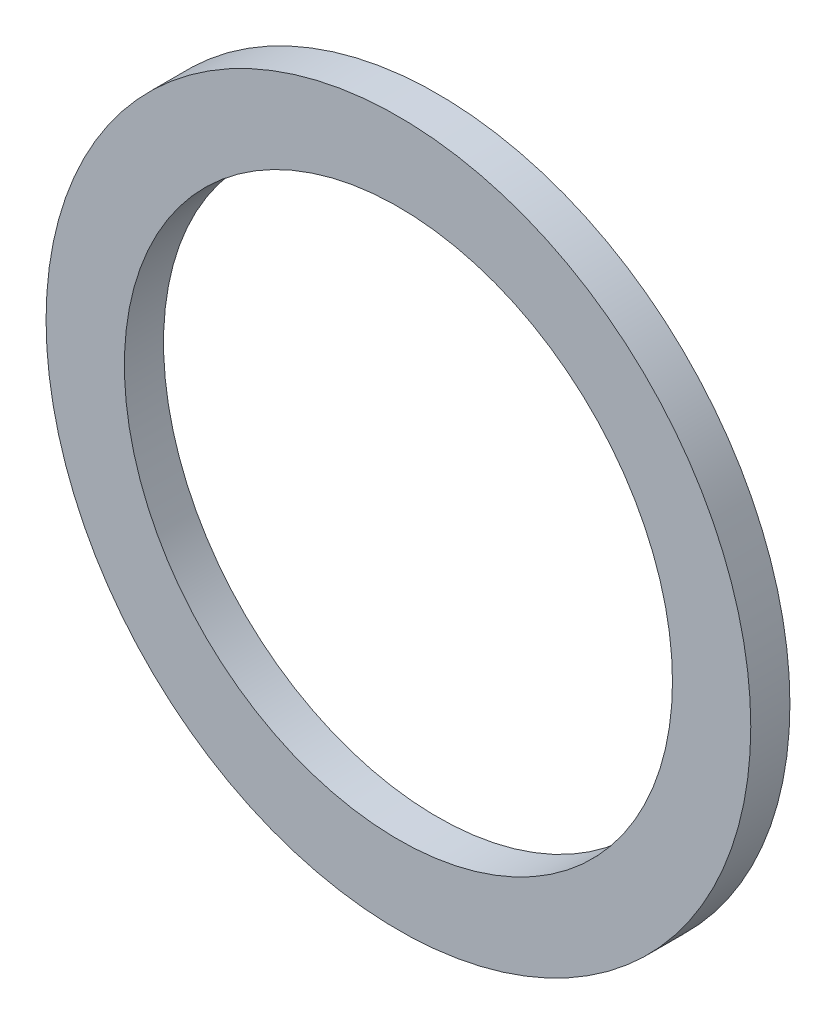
ISO-10303-21;
HEADER;
FILE_DESCRIPTION(('STEP AP214'),'2;1');
FILE_NAME('part.step','',(''),(''),'','','');
FILE_SCHEMA(('AUTOMOTIVE_DESIGN { 1 0 10303 214 1 1 1 1 }'));
ENDSEC;
DATA;
#1=APPLICATION_CONTEXT('core data for automotive mechanical design processes');
#2=APPLICATION_PROTOCOL_DEFINITION('international standard','automotive_design',2000,#1);
#3=PRODUCT_CONTEXT('',#1,'mechanical');
#4=PRODUCT('Part','Part','',(#3));
#5=PRODUCT_RELATED_PRODUCT_CATEGORY('part','',(#4));
#6=PRODUCT_DEFINITION_FORMATION('','',#4);
#7=PRODUCT_DEFINITION_CONTEXT('part definition',#1,'design');
#8=PRODUCT_DEFINITION('design','',#6,#7);
#9=PRODUCT_DEFINITION_SHAPE('','',#8);
#10=(LENGTH_UNIT() NAMED_UNIT(*) SI_UNIT(.MILLI.,.METRE.));
#11=(NAMED_UNIT(*) PLANE_ANGLE_UNIT() SI_UNIT($,.RADIAN.));
#12=(NAMED_UNIT(*) SI_UNIT($,.STERADIAN.) SOLID_ANGLE_UNIT());
#13=UNCERTAINTY_MEASURE_WITH_UNIT(LENGTH_MEASURE(1.E-05),#10,'distance_accuracy_value','');
#14=(GEOMETRIC_REPRESENTATION_CONTEXT(3) GLOBAL_UNCERTAINTY_ASSIGNED_CONTEXT((#13)) GLOBAL_UNIT_ASSIGNED_CONTEXT((#10,
#11,#12)) REPRESENTATION_CONTEXT('',''));
#15=CARTESIAN_POINT('',(0.,0.,0.));
#16=DIRECTION('',(0.,0.,1.));
#17=DIRECTION('',(1.,0.,0.));
#18=AXIS2_PLACEMENT_3D('',#15,#16,#17);
#19=CARTESIAN_POINT('',(0.,0.,2.));
#20=DIRECTION('',(0.,0.,1.));
#21=DIRECTION('',(1.,0.,0.));
#22=AXIS2_PLACEMENT_3D('',#19,#20,#21);
#23=PLANE('',#22);
#24=CARTESIAN_POINT('',(0.,0.,2.));
#25=DIRECTION('',(0.,0.,1.));
#26=DIRECTION('',(1.,0.,0.));
#27=AXIS2_PLACEMENT_3D('',#24,#25,#26);
#28=CIRCLE('',#27,18.);
#29=CARTESIAN_POINT('',(18.,0.,2.));
#30=VERTEX_POINT('',#29);
#31=EDGE_CURVE('E10',#30,#30,#28,.T.);
#32=ORIENTED_EDGE('',*,*,#31,.T.);
#33=EDGE_LOOP('',(#32));
#34=FACE_BOUND('',#33,.T.);
#35=CARTESIAN_POINT('',(0.,0.,2.));
#36=DIRECTION('',(0.,0.,1.));
#37=DIRECTION('',(1.,0.,0.));
#38=AXIS2_PLACEMENT_3D('',#35,#36,#37);
#39=CIRCLE('',#38,14.);
#40=CARTESIAN_POINT('',(14.,0.,2.));
#41=VERTEX_POINT('',#40);
#42=EDGE_CURVE('E44',#41,#41,#39,.T.);
#43=ORIENTED_EDGE('',*,*,#42,.F.);
#44=EDGE_LOOP('',(#43));
#45=FACE_BOUND('',#44,.T.);
#46=ADVANCED_FACE('F33',(#34,#45),#23,.T.);
#47=CARTESIAN_POINT('',(0.,0.,0.));
#48=DIRECTION('',(0.,0.,1.));
#49=DIRECTION('',(1.,0.,0.));
#50=AXIS2_PLACEMENT_3D('',#47,#48,#49);
#51=PLANE('',#50);
#52=CARTESIAN_POINT('',(0.,0.,0.));
#53=DIRECTION('',(0.,0.,1.));
#54=DIRECTION('',(1.,0.,0.));
#55=AXIS2_PLACEMENT_3D('',#52,#53,#54);
#56=CIRCLE('',#55,18.);
#57=CARTESIAN_POINT('',(18.,0.,0.));
#58=VERTEX_POINT('',#57);
#59=EDGE_CURVE('E40',#58,#58,#56,.T.);
#60=ORIENTED_EDGE('',*,*,#59,.F.);
#61=EDGE_LOOP('',(#60));
#62=FACE_BOUND('',#61,.T.);
#63=CARTESIAN_POINT('',(0.,0.,0.));
#64=DIRECTION('',(0.,0.,1.));
#65=DIRECTION('',(1.,0.,0.));
#66=AXIS2_PLACEMENT_3D('',#63,#64,#65);
#67=CIRCLE('',#66,14.);
#68=CARTESIAN_POINT('',(14.,0.,0.));
#69=VERTEX_POINT('',#68);
#70=EDGE_CURVE('E48',#69,#69,#67,.T.);
#71=ORIENTED_EDGE('',*,*,#70,.T.);
#72=EDGE_LOOP('',(#71));
#73=FACE_BOUND('',#72,.T.);
#74=ADVANCED_FACE('F54',(#62,#73),#51,.F.);
#75=CARTESIAN_POINT('',(0.,0.,2.));
#76=DIRECTION('',(0.,0.,-1.));
#77=DIRECTION('',(-1.,0.,0.));
#78=AXIS2_PLACEMENT_3D('',#75,#76,#77);
#79=CYLINDRICAL_SURFACE('',#78,18.);
#80=ORIENTED_EDGE('',*,*,#31,.F.);
#81=EDGE_LOOP('',(#80));
#82=FACE_BOUND('',#81,.T.);
#83=ORIENTED_EDGE('',*,*,#59,.T.);
#84=EDGE_LOOP('',(#83));
#85=FACE_BOUND('',#84,.T.);
#86=ADVANCED_FACE('F35',(#82,#85),#79,.T.);
#87=CARTESIAN_POINT('',(0.,0.,2.));
#88=DIRECTION('',(0.,0.,-1.));
#89=DIRECTION('',(-1.,0.,0.));
#90=AXIS2_PLACEMENT_3D('',#87,#88,#89);
#91=CYLINDRICAL_SURFACE('',#90,14.);
#92=ORIENTED_EDGE('',*,*,#42,.T.);
#93=EDGE_LOOP('',(#92));
#94=FACE_BOUND('',#93,.T.);
#95=ORIENTED_EDGE('',*,*,#70,.F.);
#96=EDGE_LOOP('',(#95));
#97=FACE_BOUND('',#96,.T.);
#98=ADVANCED_FACE('F56',(#94,#97),#91,.F.);
#99=CLOSED_SHELL('',(#46,#74,#86,#98));
#100=MANIFOLD_SOLID_BREP('B2',#99);
#101=ADVANCED_BREP_SHAPE_REPRESENTATION('',(#18,#100),#14);
#102=SHAPE_DEFINITION_REPRESENTATION(#9,#101);
ENDSEC;
END-ISO-10303-21;
